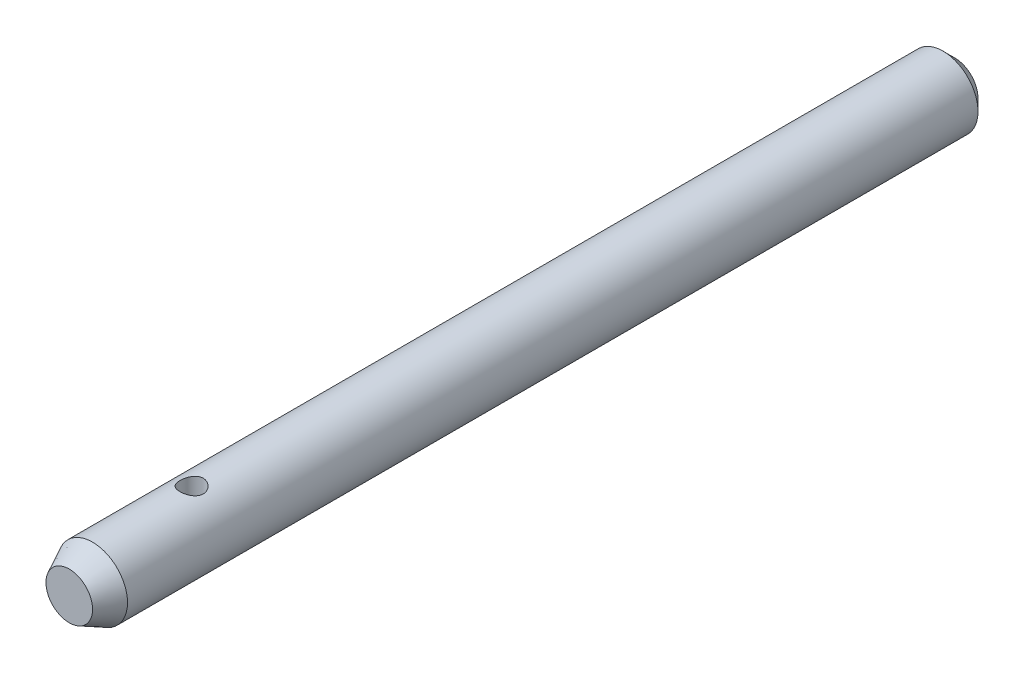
ISO-10303-21;
HEADER;
FILE_DESCRIPTION(('STEP AP214'),'2;1');
FILE_NAME('part.step','',(''),(''),'','','');
FILE_SCHEMA(('AUTOMOTIVE_DESIGN { 1 0 10303 214 1 1 1 1 }'));
ENDSEC;
DATA;
#1=APPLICATION_CONTEXT('core data for automotive mechanical design processes');
#2=APPLICATION_PROTOCOL_DEFINITION('international standard','automotive_design',2000,#1);
#3=PRODUCT_CONTEXT('',#1,'mechanical');
#4=PRODUCT('Part','Part','',(#3));
#5=PRODUCT_RELATED_PRODUCT_CATEGORY('part','',(#4));
#6=PRODUCT_DEFINITION_FORMATION('','',#4);
#7=PRODUCT_DEFINITION_CONTEXT('part definition',#1,'design');
#8=PRODUCT_DEFINITION('design','',#6,#7);
#9=PRODUCT_DEFINITION_SHAPE('','',#8);
#10=(LENGTH_UNIT() NAMED_UNIT(*) SI_UNIT(.MILLI.,.METRE.));
#11=(NAMED_UNIT(*) PLANE_ANGLE_UNIT() SI_UNIT($,.RADIAN.));
#12=(NAMED_UNIT(*) SI_UNIT($,.STERADIAN.) SOLID_ANGLE_UNIT());
#13=UNCERTAINTY_MEASURE_WITH_UNIT(LENGTH_MEASURE(1.E-05),#10,'distance_accuracy_value','');
#14=(GEOMETRIC_REPRESENTATION_CONTEXT(3) GLOBAL_UNCERTAINTY_ASSIGNED_CONTEXT((#13)) GLOBAL_UNIT_ASSIGNED_CONTEXT((#10,
#11,#12)) REPRESENTATION_CONTEXT('',''));
#15=CARTESIAN_POINT('',(0.,0.,0.));
#16=DIRECTION('',(0.,0.,1.));
#17=DIRECTION('',(1.,0.,0.));
#18=AXIS2_PLACEMENT_3D('',#15,#16,#17);
#19=CARTESIAN_POINT('',(0.,0.,76.));
#20=DIRECTION('',(0.,0.,-1.));
#21=DIRECTION('',(-1.,0.,0.));
#22=AXIS2_PLACEMENT_3D('',#19,#20,#21);
#23=CYLINDRICAL_SURFACE('',#22,3.);
#24=CARTESIAN_POINT('',(0.,-3.,66.5));
#25=CARTESIAN_POINT('',(0.0545633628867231,-3.00000015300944,66.5000002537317));
#26=CARTESIAN_POINT('',(0.10912519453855,-2.99849769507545,66.4955197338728));
#27=CARTESIAN_POINT('',(0.216641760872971,-2.99265210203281,66.4777708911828));
#28=CARTESIAN_POINT('',(0.269596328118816,-2.98830867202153,66.4645016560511));
#29=CARTESIAN_POINT('',(0.372332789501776,-2.97725307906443,66.429680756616));
#30=CARTESIAN_POINT('',(0.422119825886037,-2.97054487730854,66.4081429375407));
#31=CARTESIAN_POINT('',(0.517374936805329,-2.95544445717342,66.3574588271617));
#32=CARTESIAN_POINT('',(0.56284215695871,-2.94705190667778,66.3283110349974));
#33=CARTESIAN_POINT('',(0.649741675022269,-2.92914094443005,66.2621741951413));
#34=CARTESIAN_POINT('',(0.691003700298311,-2.91959556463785,66.2249687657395));
#35=CARTESIAN_POINT('',(0.766832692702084,-2.90060314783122,66.1442328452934));
#36=CARTESIAN_POINT('',(0.801398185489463,-2.89115613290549,66.1007009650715));
#37=CARTESIAN_POINT('',(0.863824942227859,-2.87313332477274,66.0070148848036));
#38=CARTESIAN_POINT('',(0.891464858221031,-2.86459039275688,65.9567062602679));
#39=CARTESIAN_POINT('',(0.937818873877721,-2.84975305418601,65.8518239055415));
#40=CARTESIAN_POINT('',(0.956535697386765,-2.84345796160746,65.7972514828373));
#41=CARTESIAN_POINT('',(0.983873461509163,-2.83411303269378,65.6873267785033));
#42=CARTESIAN_POINT('',(0.99281344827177,-2.83096095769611,65.632062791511));
#43=CARTESIAN_POINT('',(1.00134112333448,-2.82795656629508,65.5207362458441));
#44=CARTESIAN_POINT('',(1.00093170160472,-2.8281032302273,65.4646739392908));
#45=CARTESIAN_POINT('',(0.99101990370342,-2.8315901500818,65.356063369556));
#46=CARTESIAN_POINT('',(0.981933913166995,-2.83478415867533,65.303471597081));
#47=CARTESIAN_POINT('',(0.955606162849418,-2.84376657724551,65.2006065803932));
#48=CARTESIAN_POINT('',(0.938363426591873,-2.84955529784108,65.1503336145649));
#49=CARTESIAN_POINT('',(0.895939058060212,-2.86317911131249,65.0525872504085));
#50=CARTESIAN_POINT('',(0.87063404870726,-2.87104565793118,65.0051719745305));
#51=CARTESIAN_POINT('',(0.812889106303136,-2.88792558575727,64.9151290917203));
#52=CARTESIAN_POINT('',(0.780447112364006,-2.89693929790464,64.8725028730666));
#53=CARTESIAN_POINT('',(0.707349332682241,-2.91567329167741,64.7909084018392));
#54=CARTESIAN_POINT('',(0.666353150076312,-2.92540589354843,64.752247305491));
#55=CARTESIAN_POINT('',(0.578339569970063,-2.94406938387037,64.6822687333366));
#56=CARTESIAN_POINT('',(0.531321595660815,-2.95300019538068,64.6509519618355));
#57=CARTESIAN_POINT('',(0.431947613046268,-2.96917107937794,64.5963036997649));
#58=CARTESIAN_POINT('',(0.379543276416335,-2.9763935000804,64.5730545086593));
#59=CARTESIAN_POINT('',(0.271269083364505,-2.98820567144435,64.5357968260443));
#60=CARTESIAN_POINT('',(0.215400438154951,-2.99279633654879,64.5217851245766));
#61=CARTESIAN_POINT('',(0.1043838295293,-2.99867627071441,64.5039443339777));
#62=CARTESIAN_POINT('',(0.0493095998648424,-3.00010001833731,64.4997001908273));
#63=CARTESIAN_POINT('',(-0.0607750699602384,-2.99988902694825,64.5003326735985));
#64=CARTESIAN_POINT('',(-0.115785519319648,-2.99825480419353,64.5052077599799));
#65=CARTESIAN_POINT('',(-0.222519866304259,-2.99220024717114,64.523611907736));
#66=CARTESIAN_POINT('',(-0.274292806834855,-2.98786198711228,64.5368862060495));
#67=CARTESIAN_POINT('',(-0.374855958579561,-2.97691846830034,64.5713934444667));
#68=CARTESIAN_POINT('',(-0.423645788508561,-2.97031292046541,64.5926273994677));
#69=CARTESIAN_POINT('',(-0.518288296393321,-2.95528931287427,64.6430704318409));
#70=CARTESIAN_POINT('',(-0.564029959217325,-2.94682814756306,64.6724745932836));
#71=CARTESIAN_POINT('',(-0.6500648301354,-2.92905253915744,64.7381941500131));
#72=CARTESIAN_POINT('',(-0.690356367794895,-2.91973783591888,64.7745116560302));
#73=CARTESIAN_POINT('',(-0.766252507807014,-2.90076847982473,64.8549787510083));
#74=CARTESIAN_POINT('',(-0.801560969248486,-2.89111761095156,64.8994092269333));
#75=CARTESIAN_POINT('',(-0.864257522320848,-2.87299973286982,64.9937715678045));
#76=CARTESIAN_POINT('',(-0.891645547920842,-2.8645327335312,65.0437034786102));
#77=CARTESIAN_POINT('',(-0.937596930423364,-2.84982391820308,65.1476730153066));
#78=CARTESIAN_POINT('',(-0.956178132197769,-2.84357760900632,65.2017020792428));
#79=CARTESIAN_POINT('',(-0.983894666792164,-2.83410832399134,65.3123786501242));
#80=CARTESIAN_POINT('',(-0.993034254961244,-2.83088398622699,65.3690249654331));
#81=CARTESIAN_POINT('',(-1.00127628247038,-2.82797858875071,65.4801970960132));
#82=CARTESIAN_POINT('',(-1.00087025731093,-2.82812400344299,65.5346823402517));
#83=CARTESIAN_POINT('',(-0.991242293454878,-2.8315126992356,65.6427650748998));
#84=CARTESIAN_POINT('',(-0.982020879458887,-2.83475579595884,65.6963626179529));
#85=CARTESIAN_POINT('',(-0.955371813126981,-2.84384524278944,65.8001356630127));
#86=CARTESIAN_POINT('',(-0.938103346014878,-2.84964098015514,65.8503568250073));
#87=CARTESIAN_POINT('',(-0.895979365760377,-2.86316398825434,65.9472274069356));
#88=CARTESIAN_POINT('',(-0.871122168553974,-2.87089168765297,65.9938760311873));
#89=CARTESIAN_POINT('',(-0.813260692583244,-2.8878282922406,66.0844836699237));
#90=CARTESIAN_POINT('',(-0.779948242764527,-2.89708711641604,66.1282365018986));
#91=CARTESIAN_POINT('',(-0.706642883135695,-2.91583356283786,66.209689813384));
#92=CARTESIAN_POINT('',(-0.666648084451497,-2.92532124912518,66.247388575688));
#93=CARTESIAN_POINT('',(-0.579241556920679,-2.94390030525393,66.3171444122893));
#94=CARTESIAN_POINT('',(-0.531601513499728,-2.95296181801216,66.348924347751));
#95=CARTESIAN_POINT('',(-0.43135735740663,-2.96925991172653,66.4039904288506));
#96=CARTESIAN_POINT('',(-0.378754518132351,-2.97649695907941,66.4272787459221));
#97=CARTESIAN_POINT('',(-0.272493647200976,-2.98805515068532,66.4637216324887));
#98=CARTESIAN_POINT('',(-0.21898775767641,-2.9924921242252,66.4772824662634));
#99=CARTESIAN_POINT('',(-0.110320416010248,-2.99846407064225,66.4954202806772));
#100=CARTESIAN_POINT('',(-0.055159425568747,-2.99999984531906,66.4999997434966));
#101=CARTESIAN_POINT('',(0.,-3.,66.5));
#102=B_SPLINE_CURVE_WITH_KNOTS('',3,(#24,#25,#26,#27,#28,#29,#30,#31,#32,#33,#34,#35,#36,#37,
#38,#39,#40,#41,#42,#43,#44,#45,#46,#47,#48,#49,#50,#51,#52,#53,#54,#55,#56,#57,#58,#59,#60,#61,
#62,#63,#64,#65,#66,#67,#68,#69,#70,#71,#72,#73,#74,#75,#76,#77,#78,#79,#80,#81,#82,#83,#84,#85,
#86,#87,#88,#89,#90,#91,#92,#93,#94,#95,#96,#97,#98,#99,#100,#101),.UNSPECIFIED.,.T.,.F.,(4,2,2,
2,2,2,2,2,2,2,2,2,2,2,2,2,2,2,2,2,2,2,2,2,2,2,2,2,2,2,2,2,2,2,2,2,2,2,4),(0.,0.163487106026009,
0.326991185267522,0.490222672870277,0.653486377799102,0.821846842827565,0.990244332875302,
1.16348384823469,1.33667044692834,1.5040192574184,1.67131633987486,1.83096826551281,
1.99063930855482,2.15288171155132,2.31517102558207,2.48593305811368,2.65671145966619,
2.82918405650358,3.00159668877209,3.1665358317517,3.33144713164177,3.49158157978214,
3.65173645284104,3.81610399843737,3.98052180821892,4.15241022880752,4.32430008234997,
4.49584013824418,4.66730284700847,4.8299566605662,4.99260079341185,5.1521558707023,
5.3117463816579,5.47830066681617,5.64490211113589,5.81799660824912,5.99104681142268,
6.15636558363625,6.32163866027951),.UNSPECIFIED.);
#103=CARTESIAN_POINT('',(0.,-3.,66.5));
#104=VERTEX_POINT('',#103);
#105=EDGE_CURVE('E42',#104,#104,#102,.T.);
#106=ORIENTED_EDGE('',*,*,#105,.T.);
#107=EDGE_LOOP('',(#106));
#108=FACE_BOUND('',#107,.T.);
#109=CARTESIAN_POINT('',(0.,3.,66.5));
#110=CARTESIAN_POINT('',(-0.0545633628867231,3.00000015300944,66.5000002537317));
#111=CARTESIAN_POINT('',(-0.10912519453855,2.99849769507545,66.4955197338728));
#112=CARTESIAN_POINT('',(-0.216641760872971,2.99265210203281,66.4777708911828));
#113=CARTESIAN_POINT('',(-0.269596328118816,2.98830867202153,66.4645016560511));
#114=CARTESIAN_POINT('',(-0.372332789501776,2.97725307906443,66.429680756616));
#115=CARTESIAN_POINT('',(-0.422119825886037,2.97054487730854,66.4081429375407));
#116=CARTESIAN_POINT('',(-0.517374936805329,2.95544445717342,66.3574588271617));
#117=CARTESIAN_POINT('',(-0.56284215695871,2.94705190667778,66.3283110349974));
#118=CARTESIAN_POINT('',(-0.649741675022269,2.92914094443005,66.2621741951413));
#119=CARTESIAN_POINT('',(-0.691003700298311,2.91959556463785,66.2249687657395));
#120=CARTESIAN_POINT('',(-0.766832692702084,2.90060314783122,66.1442328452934));
#121=CARTESIAN_POINT('',(-0.801398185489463,2.89115613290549,66.1007009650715));
#122=CARTESIAN_POINT('',(-0.863824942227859,2.87313332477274,66.0070148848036));
#123=CARTESIAN_POINT('',(-0.891464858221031,2.86459039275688,65.9567062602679));
#124=CARTESIAN_POINT('',(-0.937818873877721,2.84975305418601,65.8518239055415));
#125=CARTESIAN_POINT('',(-0.956535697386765,2.84345796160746,65.7972514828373));
#126=CARTESIAN_POINT('',(-0.983873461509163,2.83411303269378,65.6873267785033));
#127=CARTESIAN_POINT('',(-0.99281344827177,2.83096095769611,65.632062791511));
#128=CARTESIAN_POINT('',(-1.00134112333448,2.82795656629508,65.5207362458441));
#129=CARTESIAN_POINT('',(-1.00093170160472,2.8281032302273,65.4646739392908));
#130=CARTESIAN_POINT('',(-0.99101990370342,2.8315901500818,65.356063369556));
#131=CARTESIAN_POINT('',(-0.981933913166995,2.83478415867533,65.303471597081));
#132=CARTESIAN_POINT('',(-0.955606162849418,2.84376657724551,65.2006065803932));
#133=CARTESIAN_POINT('',(-0.938363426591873,2.84955529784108,65.1503336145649));
#134=CARTESIAN_POINT('',(-0.895939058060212,2.86317911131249,65.0525872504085));
#135=CARTESIAN_POINT('',(-0.87063404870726,2.87104565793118,65.0051719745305));
#136=CARTESIAN_POINT('',(-0.812889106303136,2.88792558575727,64.9151290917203));
#137=CARTESIAN_POINT('',(-0.780447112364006,2.89693929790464,64.8725028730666));
#138=CARTESIAN_POINT('',(-0.707349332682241,2.91567329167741,64.7909084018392));
#139=CARTESIAN_POINT('',(-0.666353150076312,2.92540589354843,64.752247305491));
#140=CARTESIAN_POINT('',(-0.578339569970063,2.94406938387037,64.6822687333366));
#141=CARTESIAN_POINT('',(-0.531321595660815,2.95300019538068,64.6509519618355));
#142=CARTESIAN_POINT('',(-0.431947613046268,2.96917107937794,64.5963036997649));
#143=CARTESIAN_POINT('',(-0.379543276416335,2.9763935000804,64.5730545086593));
#144=CARTESIAN_POINT('',(-0.271269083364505,2.98820567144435,64.5357968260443));
#145=CARTESIAN_POINT('',(-0.215400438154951,2.99279633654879,64.5217851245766));
#146=CARTESIAN_POINT('',(-0.1043838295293,2.99867627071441,64.5039443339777));
#147=CARTESIAN_POINT('',(-0.0493095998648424,3.00010001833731,64.4997001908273));
#148=CARTESIAN_POINT('',(0.0607750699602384,2.99988902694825,64.5003326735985));
#149=CARTESIAN_POINT('',(0.115785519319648,2.99825480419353,64.5052077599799));
#150=CARTESIAN_POINT('',(0.222519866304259,2.99220024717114,64.523611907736));
#151=CARTESIAN_POINT('',(0.274292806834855,2.98786198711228,64.5368862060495));
#152=CARTESIAN_POINT('',(0.374855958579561,2.97691846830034,64.5713934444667));
#153=CARTESIAN_POINT('',(0.423645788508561,2.97031292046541,64.5926273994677));
#154=CARTESIAN_POINT('',(0.518288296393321,2.95528931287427,64.6430704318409));
#155=CARTESIAN_POINT('',(0.564029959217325,2.94682814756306,64.6724745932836));
#156=CARTESIAN_POINT('',(0.6500648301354,2.92905253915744,64.7381941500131));
#157=CARTESIAN_POINT('',(0.690356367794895,2.91973783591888,64.7745116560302));
#158=CARTESIAN_POINT('',(0.766252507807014,2.90076847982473,64.8549787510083));
#159=CARTESIAN_POINT('',(0.801560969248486,2.89111761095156,64.8994092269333));
#160=CARTESIAN_POINT('',(0.864257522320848,2.87299973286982,64.9937715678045));
#161=CARTESIAN_POINT('',(0.891645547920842,2.8645327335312,65.0437034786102));
#162=CARTESIAN_POINT('',(0.937596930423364,2.84982391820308,65.1476730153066));
#163=CARTESIAN_POINT('',(0.956178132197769,2.84357760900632,65.2017020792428));
#164=CARTESIAN_POINT('',(0.983894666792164,2.83410832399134,65.3123786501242));
#165=CARTESIAN_POINT('',(0.993034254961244,2.83088398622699,65.3690249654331));
#166=CARTESIAN_POINT('',(1.00127628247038,2.82797858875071,65.4801970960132));
#167=CARTESIAN_POINT('',(1.00087025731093,2.82812400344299,65.5346823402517));
#168=CARTESIAN_POINT('',(0.991242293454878,2.8315126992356,65.6427650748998));
#169=CARTESIAN_POINT('',(0.982020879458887,2.83475579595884,65.6963626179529));
#170=CARTESIAN_POINT('',(0.955371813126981,2.84384524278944,65.8001356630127));
#171=CARTESIAN_POINT('',(0.938103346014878,2.84964098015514,65.8503568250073));
#172=CARTESIAN_POINT('',(0.895979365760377,2.86316398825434,65.9472274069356));
#173=CARTESIAN_POINT('',(0.871122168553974,2.87089168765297,65.9938760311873));
#174=CARTESIAN_POINT('',(0.813260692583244,2.8878282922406,66.0844836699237));
#175=CARTESIAN_POINT('',(0.779948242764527,2.89708711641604,66.1282365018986));
#176=CARTESIAN_POINT('',(0.706642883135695,2.91583356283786,66.209689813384));
#177=CARTESIAN_POINT('',(0.666648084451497,2.92532124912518,66.247388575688));
#178=CARTESIAN_POINT('',(0.579241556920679,2.94390030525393,66.3171444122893));
#179=CARTESIAN_POINT('',(0.531601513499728,2.95296181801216,66.348924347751));
#180=CARTESIAN_POINT('',(0.43135735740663,2.96925991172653,66.4039904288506));
#181=CARTESIAN_POINT('',(0.378754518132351,2.97649695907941,66.4272787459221));
#182=CARTESIAN_POINT('',(0.272493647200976,2.98805515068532,66.4637216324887));
#183=CARTESIAN_POINT('',(0.21898775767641,2.9924921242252,66.4772824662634));
#184=CARTESIAN_POINT('',(0.110320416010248,2.99846407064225,66.4954202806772));
#185=CARTESIAN_POINT('',(0.055159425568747,2.99999984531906,66.4999997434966));
#186=CARTESIAN_POINT('',(0.,3.,66.5));
#187=B_SPLINE_CURVE_WITH_KNOTS('',3,(#109,#110,#111,#112,#113,#114,#115,#116,#117,#118,#119,
#120,#121,#122,#123,#124,#125,#126,#127,#128,#129,#130,#131,#132,#133,#134,#135,#136,#137,#138,
#139,#140,#141,#142,#143,#144,#145,#146,#147,#148,#149,#150,#151,#152,#153,#154,#155,#156,#157,
#158,#159,#160,#161,#162,#163,#164,#165,#166,#167,#168,#169,#170,#171,#172,#173,#174,#175,#176,
#177,#178,#179,#180,#181,#182,#183,#184,#185,#186),.UNSPECIFIED.,.T.,.F.,(4,2,2,2,2,2,2,2,2,2,2,
2,2,2,2,2,2,2,2,2,2,2,2,2,2,2,2,2,2,2,2,2,2,2,2,2,2,2,4),(0.,0.163487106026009,
0.326991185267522,0.490222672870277,0.653486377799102,0.821846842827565,0.990244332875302,
1.16348384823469,1.33667044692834,1.5040192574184,1.67131633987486,1.83096826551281,
1.99063930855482,2.15288171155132,2.31517102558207,2.48593305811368,2.65671145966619,
2.82918405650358,3.00159668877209,3.1665358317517,3.33144713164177,3.49158157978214,
3.65173645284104,3.81610399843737,3.98052180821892,4.15241022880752,4.32430008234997,
4.49584013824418,4.66730284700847,4.8299566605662,4.99260079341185,5.1521558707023,
5.3117463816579,5.47830066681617,5.64490211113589,5.81799660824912,5.99104681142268,
6.15636558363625,6.32163866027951),.UNSPECIFIED.);
#188=CARTESIAN_POINT('',(0.,3.,66.5));
#189=VERTEX_POINT('',#188);
#190=EDGE_CURVE('E59',#189,#189,#187,.T.);
#191=ORIENTED_EDGE('',*,*,#190,.T.);
#192=EDGE_LOOP('',(#191));
#193=FACE_BOUND('',#192,.T.);
#194=CARTESIAN_POINT('',(0.,0.,1.));
#195=DIRECTION('',(0.,0.,1.));
#196=DIRECTION('',(1.,0.,0.));
#197=AXIS2_PLACEMENT_3D('',#194,#195,#196);
#198=CIRCLE('',#197,3.);
#199=CARTESIAN_POINT('',(3.,0.,1.));
#200=VERTEX_POINT('',#199);
#201=EDGE_CURVE('E51',#200,#200,#198,.T.);
#202=ORIENTED_EDGE('',*,*,#201,.T.);
#203=EDGE_LOOP('',(#202));
#204=FACE_BOUND('',#203,.T.);
#205=CARTESIAN_POINT('',(0.,0.,74.));
#206=DIRECTION('',(0.,0.,1.));
#207=DIRECTION('',(1.,0.,0.));
#208=AXIS2_PLACEMENT_3D('',#205,#206,#207);
#209=CIRCLE('',#208,3.);
#210=CARTESIAN_POINT('',(3.,0.,74.));
#211=VERTEX_POINT('',#210);
#212=EDGE_CURVE('E56',#211,#211,#209,.F.);
#213=ORIENTED_EDGE('',*,*,#212,.T.);
#214=EDGE_LOOP('',(#213));
#215=FACE_BOUND('',#214,.T.);
#216=ADVANCED_FACE('F38',(#108,#193,#204,#215),#23,.T.);
#217=CARTESIAN_POINT('',(0.,0.,76.));
#218=DIRECTION('',(0.,0.,1.));
#219=DIRECTION('',(1.,0.,0.));
#220=AXIS2_PLACEMENT_3D('',#217,#218,#219);
#221=PLANE('',#220);
#222=CARTESIAN_POINT('',(0.,0.,76.));
#223=DIRECTION('',(0.,0.,1.));
#224=DIRECTION('',(1.,0.,0.));
#225=AXIS2_PLACEMENT_3D('',#222,#223,#224);
#226=CIRCLE('',#225,1.99999999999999);
#227=CARTESIAN_POINT('',(1.99999999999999,0.,76.));
#228=VERTEX_POINT('',#227);
#229=EDGE_CURVE('E95',#228,#228,#226,.T.);
#230=ORIENTED_EDGE('',*,*,#229,.T.);
#231=EDGE_LOOP('',(#230));
#232=FACE_BOUND('',#231,.T.);
#233=ADVANCED_FACE('F71',(#232),#221,.T.);
#234=CARTESIAN_POINT('',(0.,0.,0.));
#235=DIRECTION('',(0.,0.,1.));
#236=DIRECTION('',(1.,0.,0.));
#237=AXIS2_PLACEMENT_3D('',#234,#235,#236);
#238=PLANE('',#237);
#239=CARTESIAN_POINT('',(0.,0.,0.));
#240=DIRECTION('',(0.,0.,1.));
#241=DIRECTION('',(1.,0.,0.));
#242=AXIS2_PLACEMENT_3D('',#239,#240,#241);
#243=CIRCLE('',#242,2.);
#244=CARTESIAN_POINT('',(2.,0.,0.));
#245=VERTEX_POINT('',#244);
#246=EDGE_CURVE('E10',#245,#245,#243,.F.);
#247=ORIENTED_EDGE('',*,*,#246,.T.);
#248=EDGE_LOOP('',(#247));
#249=FACE_BOUND('',#248,.T.);
#250=ADVANCED_FACE('F74',(#249),#238,.F.);
#251=CARTESIAN_POINT('',(0.,0.,76.));
#252=DIRECTION('',(0.,0.,-1.));
#253=DIRECTION('',(-1.,0.,0.));
#254=AXIS2_PLACEMENT_3D('',#251,#252,#253);
#255=CONICAL_SURFACE('',#254,1.99999999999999,0.463647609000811);
#256=ORIENTED_EDGE('',*,*,#212,.F.);
#257=EDGE_LOOP('',(#256));
#258=FACE_BOUND('',#257,.T.);
#259=ORIENTED_EDGE('',*,*,#229,.F.);
#260=EDGE_LOOP('',(#259));
#261=FACE_BOUND('',#260,.T.);
#262=ADVANCED_FACE('F77',(#258,#261),#255,.T.);
#263=CARTESIAN_POINT('',(0.,0.,1.));
#264=DIRECTION('',(0.,0.,1.));
#265=DIRECTION('',(1.,0.,0.));
#266=AXIS2_PLACEMENT_3D('',#263,#264,#265);
#267=CONICAL_SURFACE('',#266,3.,0.785398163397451);
#268=ORIENTED_EDGE('',*,*,#246,.F.);
#269=EDGE_LOOP('',(#268));
#270=FACE_BOUND('',#269,.T.);
#271=ORIENTED_EDGE('',*,*,#201,.F.);
#272=EDGE_LOOP('',(#271));
#273=FACE_BOUND('',#272,.T.);
#274=ADVANCED_FACE('F40',(#270,#273),#267,.T.);
#275=CARTESIAN_POINT('',(0.,-5.,65.5));
#276=DIRECTION('',(0.,1.,0.));
#277=DIRECTION('',(0.,0.,1.));
#278=AXIS2_PLACEMENT_3D('',#275,#276,#277);
#279=CYLINDRICAL_SURFACE('',#278,1.);
#280=ORIENTED_EDGE('',*,*,#190,.F.);
#281=EDGE_LOOP('',(#280));
#282=FACE_BOUND('',#281,.T.);
#283=ORIENTED_EDGE('',*,*,#105,.F.);
#284=EDGE_LOOP('',(#283));
#285=FACE_BOUND('',#284,.T.);
#286=ADVANCED_FACE('F66',(#282,#285),#279,.F.);
#287=CLOSED_SHELL('',(#216,#233,#250,#262,#274,#286));
#288=MANIFOLD_SOLID_BREP('B2',#287);
#289=ADVANCED_BREP_SHAPE_REPRESENTATION('',(#18,#288),#14);
#290=SHAPE_DEFINITION_REPRESENTATION(#9,#289);
ENDSEC;
END-ISO-10303-21;
